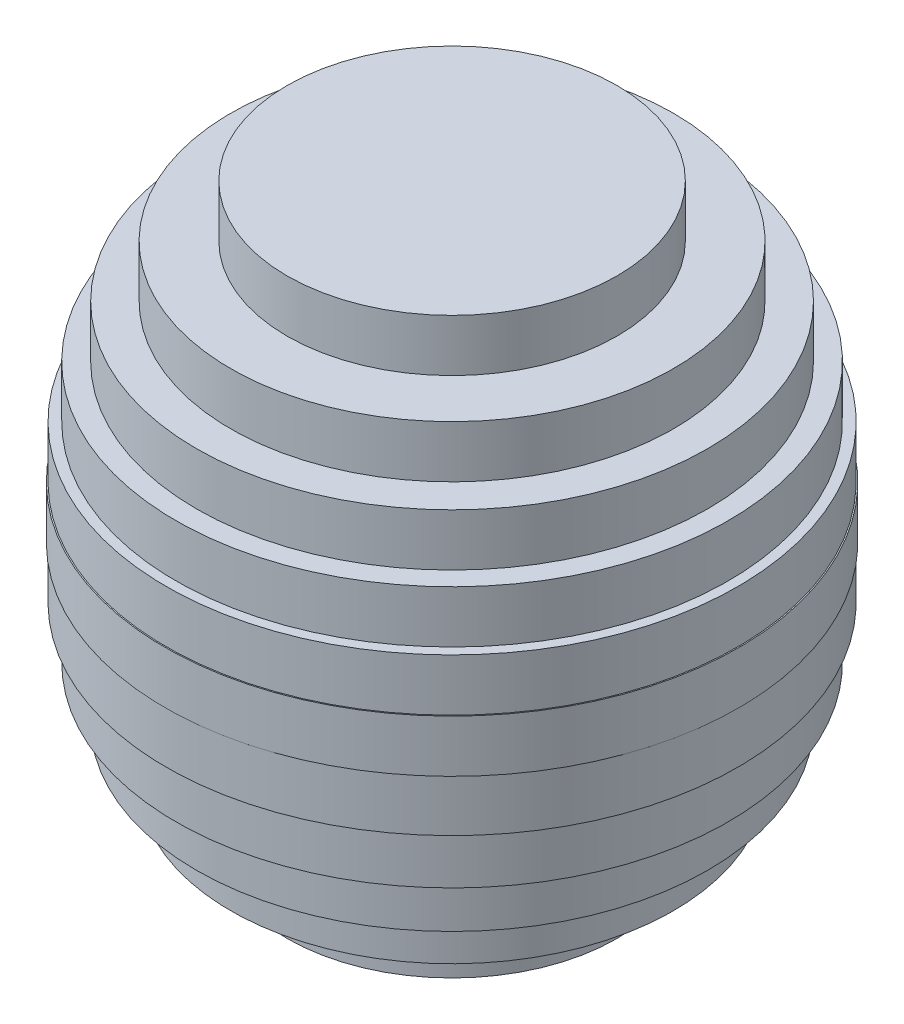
from build123d import *


with BuildPart() as part:
    # Sketch2 → Revolve2 (revolve)
    with BuildSketch(Plane.XY, mode=Mode.PRIVATE) as revolve2_sk:
        Polygon((27.5, 2.5), (27.5, -2.5), (27.386127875, -2.5), (27.386127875, -7.5), (26.457513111, -7.5), (26.457513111, -12.5), (24.494897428, -12.5), (24.494897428, -17.5), (21.213203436, -17.5), (21.213203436, -22.5), (15.811388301, -22.5), (15.811388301, -27.5), (0, -27.5), (0, 27.5), (15.811388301, 27.5), (15.811388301, 22.5), (21.213203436, 22.5), (21.213203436, 17.5), (24.494897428, 17.5), (24.494897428, 12.5), (26.457513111, 12.5), (26.457513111, 7.5), (27.386127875, 7.5), (27.386127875, 2.5), align=None)
    revolve(revolve2_sk.sketch.rotate(Axis((0, -27.5, 0), (0, 1, 0)), 90), axis=Axis((0, -27.5, 0), (0, 1, 0)))


solid = part.part
